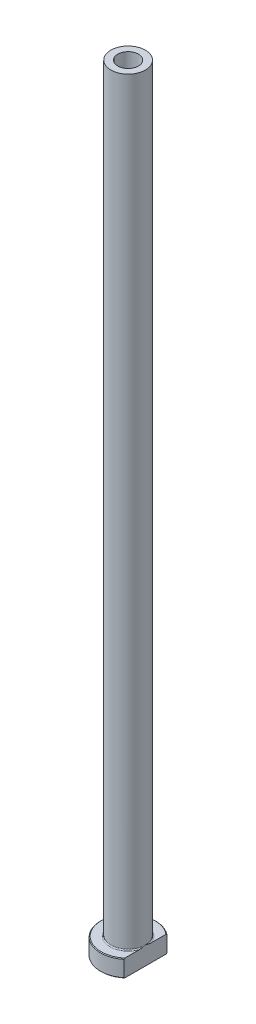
from build123d import *

# Parameters (mm, degrees)
FILLET1_R          = 0.3
CHAMFER1_SIZE      = 0.2
CUT_EXTRUDE1_DEPTH = 226.284264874
CHAMFER2_SIZE      = 0.5


with BuildPart() as part:
    # Sketch1 → Revolve1 (revolve)
    with BuildSketch(Plane.XY, mode=Mode.PRIVATE) as revolve1_sk:
        Polygon((-3, 225), (-5, 225), (-5, 5), (-8, 5), (-8, 0), (-3.25, 0), (-3.25, 168), (-3, 180), align=None)
    revolve(revolve1_sk.sketch.rotate(Axis((0, 92.187680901, 0), (0, -1, 0)), 270), axis=Axis((0, 92.187680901, 0), (0, -1, 0)))

    # Fillet1
    fillet1_edges = [part.edges().sort_by_distance(p)[0] for p in [
        (0, 5, -5),
    ]]
    fillet(fillet1_edges, radius=FILLET1_R)

    # Chamfer1
    chamfer1_edges = [part.edges().sort_by_distance(p)[0] for p in [
        (0, 0, -8),
        (0, 5, -8),
    ]]
    chamfer(chamfer1_edges, length=CHAMFER1_SIZE)

    # Sketch2 → Cut-Extrude1 (cut, through all)
    with BuildSketch(Plane.XZ):
        with BuildLine():
            Line((5, 6.244997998), (5, -6.244997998))
            ThreePointArc((5, -6.244997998), (8, 0), (5, 6.244997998))
        make_face()
    extrude(amount=-CUT_EXTRUDE1_DEPTH, mode=Mode.SUBTRACT)

    # Chamfer2
    chamfer2_edges = [part.edges().sort_by_distance(p)[0] for p in [
        (0, 0, -3.25),
    ]]
    chamfer(chamfer2_edges, length=CHAMFER2_SIZE)


solid = part.part
